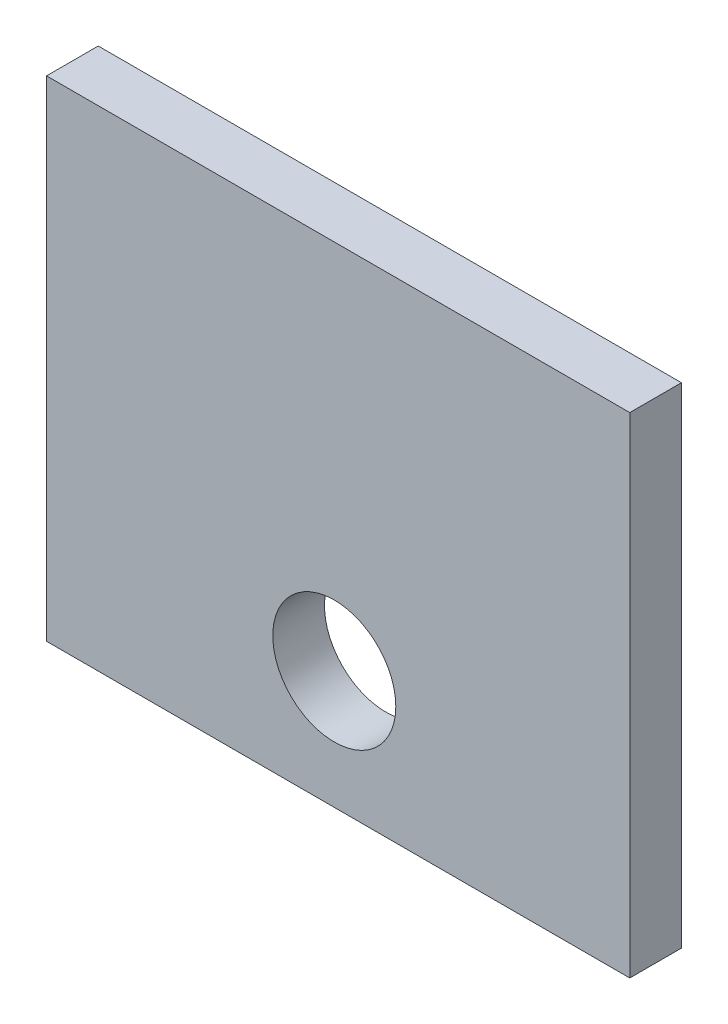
from build123d import *

# Parameters (mm, degrees)
SKETCH1_W           = 56.405993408
SKETCH1_H           = 47.360068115
SKETCH1_R           = 5.95
BOSS_EXTRUDE1_DEPTH = 5


with BuildPart() as part:
    # Sketch1 → Boss-Extrude1 (new body)
    with BuildSketch(Plane.XY):
        with Locations((-8.17698775, 3.963103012)):
            Rectangle(SKETCH1_W, SKETCH1_H)
        with Locations((-8.550310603, -8.292407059)):
            Circle(SKETCH1_R, mode=Mode.SUBTRACT)
    extrude(amount=BOSS_EXTRUDE1_DEPTH)


solid = part.part
